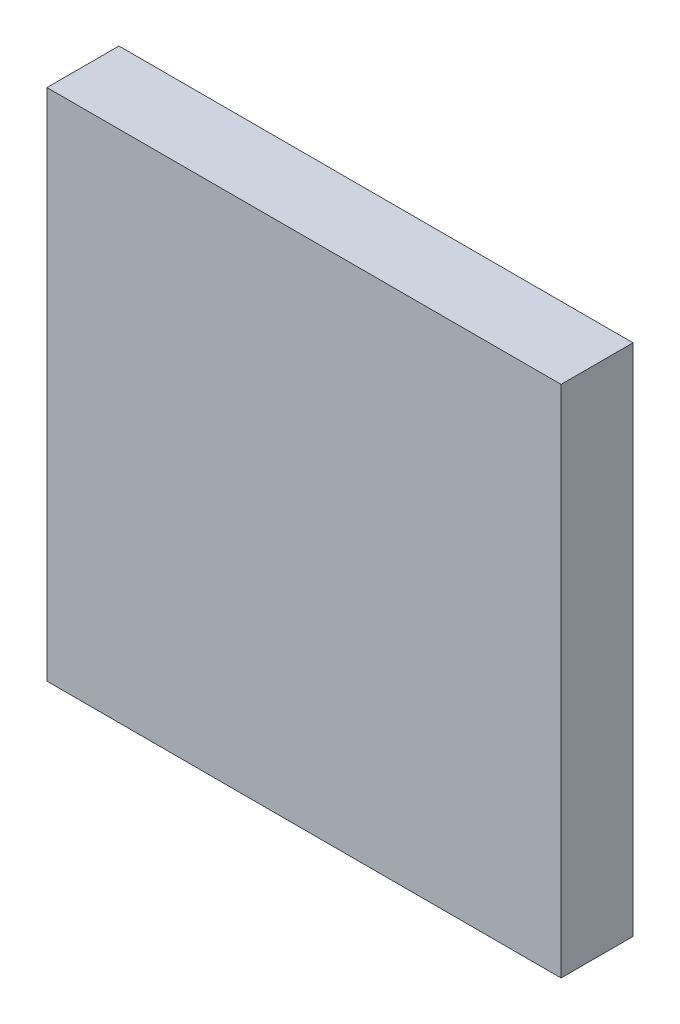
from build123d import *

# Parameters (mm, degrees)
SKETCH1_W      = 25
SKETCH1_H      = 25
EXTRUDE1_DEPTH = 3.5


with BuildPart() as part:
    # Sketch1 → Extrude1 (new body)
    with BuildSketch(Plane.XY):
        with Locations((12.5, 12.5)):
            Rectangle(SKETCH1_W, SKETCH1_H)
    extrude(amount=EXTRUDE1_DEPTH)


solid = part.part
